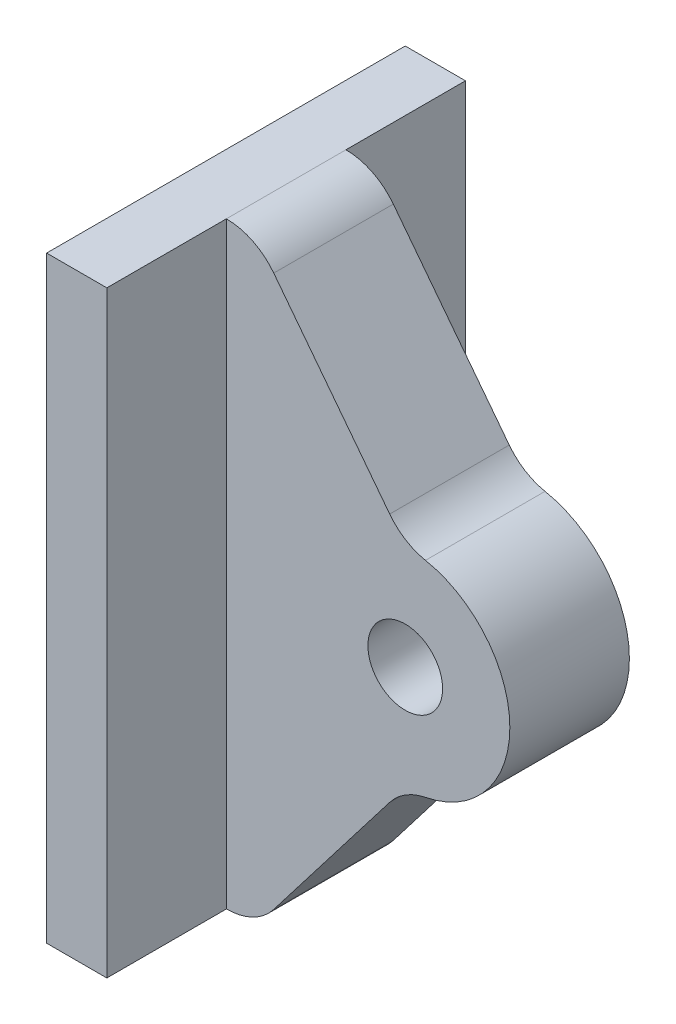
from build123d import *

# Parameters (mm, degrees)
EXTRUDE1_DEPTH     = 5.08
SKETCH2_R          = 1.5875
CUT_EXTRUDE1_DEPTH = 159.115690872
SKETCH3_W          = 2.559300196
SKETCH3_H          = 25.4
EXTRUDE2_DEPTH     = 5.08
SKETCH4_W          = 2.559300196
SKETCH4_H          = 25.4
EXTRUDE3_DEPTH     = 5.08


with BuildPart() as part:
    # Sketch1 → Extrude1 (new body)
    with BuildSketch(Plane.XY):
        with BuildLine():
            Line((-34.585776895, -128.206668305), (-37.145077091, -128.206668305))
            Line((-37.145077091, -128.206668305), (-37.145077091, -153.606668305))
            Line((-37.145077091, -153.606668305), (-34.585776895, -153.606668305))
            ThreePointArc((-34.585776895, -153.606668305), (-33.463727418, -153.345397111), (-32.572511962, -152.615333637))
            Line((-32.572511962, -152.615333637), (-27.6459759, -146.210836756))
            ThreePointArc((-27.6459759, -146.210836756), (-26.971083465, -145.600715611), (-26.124480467, -145.267562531))
            ThreePointArc((-26.124480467, -145.267562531), (-22.540077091, -140.906668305), (-26.124480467, -136.545774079))
            ThreePointArc((-26.124480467, -136.545774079), (-26.971083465, -136.212620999), (-27.6459759, -135.602499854))
            Line((-27.6459759, -135.602499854), (-32.572511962, -129.198002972))
            ThreePointArc((-32.572511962, -129.198002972), (-33.463727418, -128.467939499), (-34.585776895, -128.206668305))
        make_face()
    extrude(amount=EXTRUDE1_DEPTH)

    # Sketch2 → Cut-Extrude1 (cut, through all)
    with BuildSketch(Plane.XY.offset(5.08)):
        with Locations((-26.985077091, -140.906668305)):
            Circle(SKETCH2_R)
    extrude(amount=-CUT_EXTRUDE1_DEPTH, mode=Mode.SUBTRACT)

    # Sketch3 → Extrude2 (add)
    with BuildSketch(Plane.XY.offset(5.08)):
        with Locations((-35.865426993, -140.906668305)):
            Rectangle(SKETCH3_W, SKETCH3_H)
    extrude(amount=EXTRUDE2_DEPTH)

    # Sketch4 → Extrude3 (add)
    with BuildSketch(Plane(origin=(0, 0, 0), x_dir=(-1, 0, 0), z_dir=(0, 0, -1))):
        with Locations((35.865426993, -140.906668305)):
            Rectangle(SKETCH4_W, SKETCH4_H)
    extrude(amount=EXTRUDE3_DEPTH)


solid = part.part
